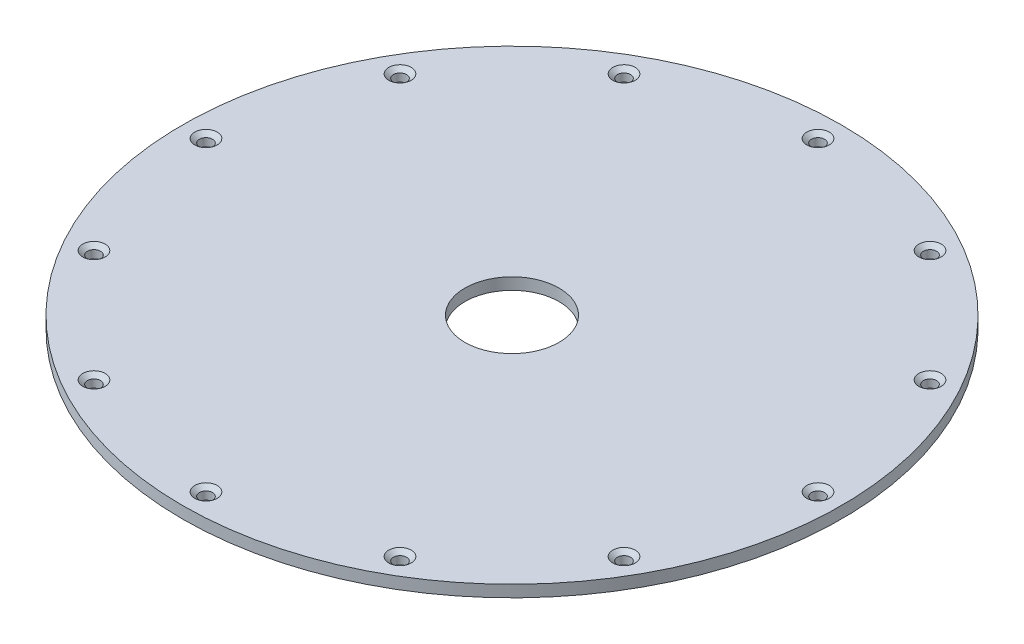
from build123d import *

# Parameters (mm, degrees)
SKETCH1_W                                         = 38.1
SKETCH1_H                                         = 1.5875
CSK_FOR_0_FLAT_HEAD_MACHINE_SCREW_100_D           = 1.778
CSK_FOR_0_FLAT_HEAD_MACHINE_SCREW_100_CSINK_D     = 3.0226
CSK_FOR_0_FLAT_HEAD_MACHINE_SCREW_100_CSINK_ANGLE = 100
CIRPATTERN1_COUNT                                 = 12


with BuildPart() as part:
    # Sketch1 → Revolve1 (revolve)
    with BuildSketch(Plane.XY, mode=Mode.PRIVATE) as revolve1_sk:
        with Locations((-25.4, 0.79375)):
            Rectangle(SKETCH1_W, SKETCH1_H)
    revolve(revolve1_sk.sketch.rotate(Axis((0, 55, 0), (0, -1, 0)), 270), axis=Axis((0, 55, 0), (0, -1, 0)))

    # CSK for _0 Flat Head Machine Screw _100 (through all)
    with Locations(Plane(origin=(0, 1.5875, 0), x_dir=(1, 0, 0), z_dir=(0, 1, 0))):
        with Locations((-41.275, 0)):
            csk_for_0_flat_head_machine_screw_100 = CounterSinkHole(CSK_FOR_0_FLAT_HEAD_MACHINE_SCREW_100_D / 2, CSK_FOR_0_FLAT_HEAD_MACHINE_SCREW_100_CSINK_D / 2, counter_sink_angle=CSK_FOR_0_FLAT_HEAD_MACHINE_SCREW_100_CSINK_ANGLE)

    # CirPattern1: CSK for _0 Flat Head Machine Screw _100 ×12 about axis
    cirpattern1_axis = Axis((0, 0, 0), (0, 1, 0))
    for i in range(1, CIRPATTERN1_COUNT):
        add(csk_for_0_flat_head_machine_screw_100.rotate(cirpattern1_axis, i * 360 / CIRPATTERN1_COUNT), mode=Mode.SUBTRACT)


solid = part.part
